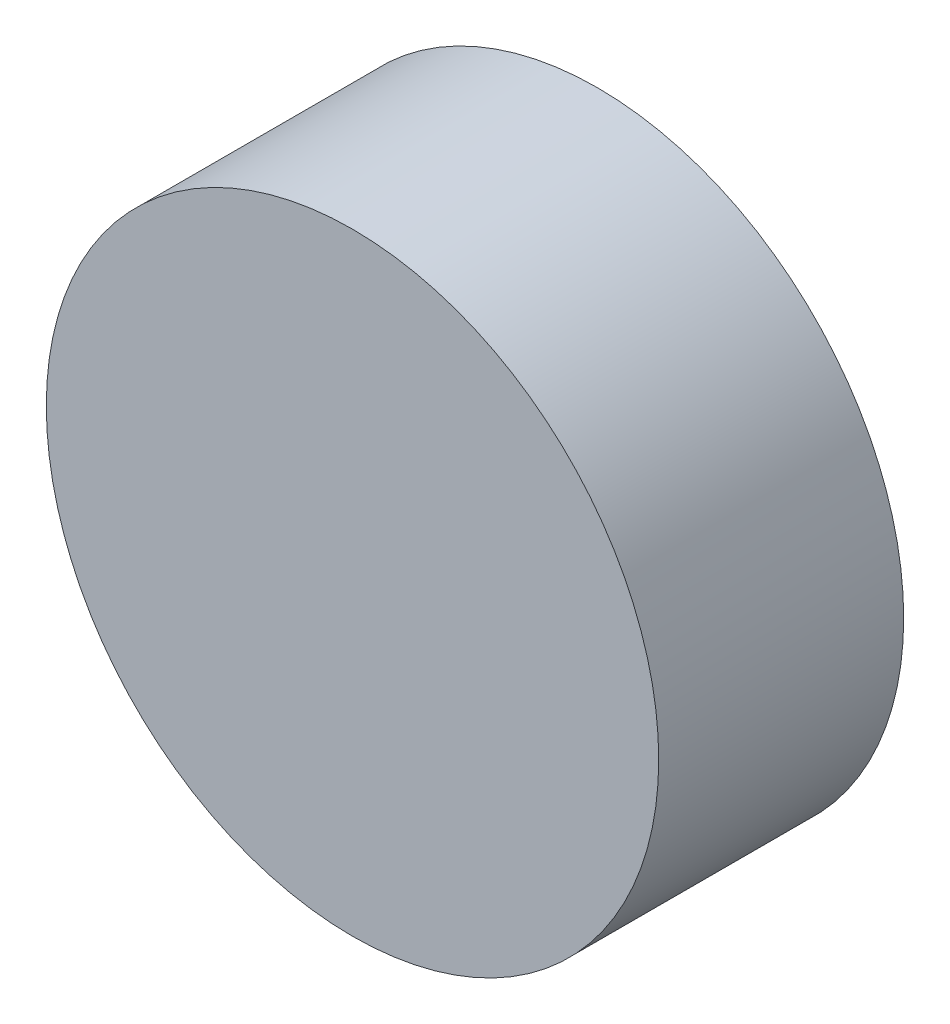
ISO-10303-21;
HEADER;
FILE_DESCRIPTION(('STEP AP214'),'2;1');
FILE_NAME('part.step','',(''),(''),'','','');
FILE_SCHEMA(('AUTOMOTIVE_DESIGN { 1 0 10303 214 1 1 1 1 }'));
ENDSEC;
DATA;
#1=APPLICATION_CONTEXT('core data for automotive mechanical design processes');
#2=APPLICATION_PROTOCOL_DEFINITION('international standard','automotive_design',2000,#1);
#3=PRODUCT_CONTEXT('',#1,'mechanical');
#4=PRODUCT('Part','Part','',(#3));
#5=PRODUCT_RELATED_PRODUCT_CATEGORY('part','',(#4));
#6=PRODUCT_DEFINITION_FORMATION('','',#4);
#7=PRODUCT_DEFINITION_CONTEXT('part definition',#1,'design');
#8=PRODUCT_DEFINITION('design','',#6,#7);
#9=PRODUCT_DEFINITION_SHAPE('','',#8);
#10=(LENGTH_UNIT() NAMED_UNIT(*) SI_UNIT(.MILLI.,.METRE.));
#11=(NAMED_UNIT(*) PLANE_ANGLE_UNIT() SI_UNIT($,.RADIAN.));
#12=(NAMED_UNIT(*) SI_UNIT($,.STERADIAN.) SOLID_ANGLE_UNIT());
#13=UNCERTAINTY_MEASURE_WITH_UNIT(LENGTH_MEASURE(1.E-05),#10,'distance_accuracy_value','');
#14=(GEOMETRIC_REPRESENTATION_CONTEXT(3) GLOBAL_UNCERTAINTY_ASSIGNED_CONTEXT((#13)) GLOBAL_UNIT_ASSIGNED_CONTEXT((#10,
#11,#12)) REPRESENTATION_CONTEXT('',''));
#15=CARTESIAN_POINT('',(0.,0.,0.));
#16=DIRECTION('',(0.,0.,1.));
#17=DIRECTION('',(1.,0.,0.));
#18=AXIS2_PLACEMENT_3D('',#15,#16,#17);
#19=CARTESIAN_POINT('',(0.,0.,30.));
#20=DIRECTION('',(0.,0.,1.));
#21=DIRECTION('',(1.,0.,0.));
#22=AXIS2_PLACEMENT_3D('',#19,#20,#21);
#23=CYLINDRICAL_SURFACE('',#22,12.5);
#24=CARTESIAN_POINT('',(0.,0.,10.));
#25=DIRECTION('',(0.,0.,1.));
#26=DIRECTION('',(1.,0.,0.));
#27=AXIS2_PLACEMENT_3D('',#24,#25,#26);
#28=CIRCLE('',#27,12.5);
#29=CARTESIAN_POINT('',(12.5,0.,10.));
#30=VERTEX_POINT('',#29);
#31=EDGE_CURVE('E8',#30,#30,#28,.T.);
#32=ORIENTED_EDGE('',*,*,#31,.F.);
#33=EDGE_LOOP('',(#32));
#34=FACE_BOUND('',#33,.T.);
#35=CARTESIAN_POINT('',(0.,0.,0.));
#36=DIRECTION('',(0.,0.,1.));
#37=DIRECTION('',(1.,0.,0.));
#38=AXIS2_PLACEMENT_3D('',#35,#36,#37);
#39=CIRCLE('',#38,12.5);
#40=CARTESIAN_POINT('',(12.5,0.,0.));
#41=VERTEX_POINT('',#40);
#42=EDGE_CURVE('E27',#41,#41,#39,.T.);
#43=ORIENTED_EDGE('',*,*,#42,.T.);
#44=EDGE_LOOP('',(#43));
#45=FACE_BOUND('',#44,.T.);
#46=ADVANCED_FACE('F13',(#34,#45),#23,.T.);
#47=CARTESIAN_POINT('',(12.5,0.,10.));
#48=DIRECTION('',(0.,0.,-1.));
#49=DIRECTION('',(-1.,0.,0.));
#50=AXIS2_PLACEMENT_3D('',#47,#48,#49);
#51=PLANE('',#50);
#52=ORIENTED_EDGE('',*,*,#31,.T.);
#53=EDGE_LOOP('',(#52));
#54=FACE_BOUND('',#53,.T.);
#55=ADVANCED_FACE('F49',(#54),#51,.F.);
#56=CARTESIAN_POINT('',(0.,0.,5.));
#57=DIRECTION('',(0.,0.,1.));
#58=DIRECTION('',(1.,0.,0.));
#59=AXIS2_PLACEMENT_3D('',#56,#57,#58);
#60=PLANE('',#59);
#61=CARTESIAN_POINT('',(0.,0.,5.));
#62=DIRECTION('',(0.,0.,1.));
#63=DIRECTION('',(1.,0.,0.));
#64=AXIS2_PLACEMENT_3D('',#61,#62,#63);
#65=CIRCLE('',#64,3.);
#66=CARTESIAN_POINT('',(3.,0.,5.));
#67=VERTEX_POINT('',#66);
#68=EDGE_CURVE('E19',#67,#67,#65,.T.);
#69=ORIENTED_EDGE('',*,*,#68,.F.);
#70=EDGE_LOOP('',(#69));
#71=FACE_BOUND('',#70,.T.);
#72=ADVANCED_FACE('F42',(#71),#60,.F.);
#73=CARTESIAN_POINT('',(0.,0.,30.));
#74=DIRECTION('',(0.,0.,1.));
#75=DIRECTION('',(1.,0.,0.));
#76=AXIS2_PLACEMENT_3D('',#73,#74,#75);
#77=CYLINDRICAL_SURFACE('',#76,3.);
#78=CARTESIAN_POINT('',(0.,0.,0.));
#79=DIRECTION('',(0.,0.,1.));
#80=DIRECTION('',(1.,0.,0.));
#81=AXIS2_PLACEMENT_3D('',#78,#79,#80);
#82=CIRCLE('',#81,3.);
#83=CARTESIAN_POINT('',(3.,0.,0.));
#84=VERTEX_POINT('',#83);
#85=EDGE_CURVE('E23',#84,#84,#82,.T.);
#86=ORIENTED_EDGE('',*,*,#85,.F.);
#87=EDGE_LOOP('',(#86));
#88=FACE_BOUND('',#87,.T.);
#89=ORIENTED_EDGE('',*,*,#68,.T.);
#90=EDGE_LOOP('',(#89));
#91=FACE_BOUND('',#90,.T.);
#92=ADVANCED_FACE('F37',(#88,#91),#77,.F.);
#93=CARTESIAN_POINT('',(3.,0.,0.));
#94=DIRECTION('',(0.,0.,1.));
#95=DIRECTION('',(1.,0.,0.));
#96=AXIS2_PLACEMENT_3D('',#93,#94,#95);
#97=PLANE('',#96);
#98=ORIENTED_EDGE('',*,*,#42,.F.);
#99=EDGE_LOOP('',(#98));
#100=FACE_BOUND('',#99,.T.);
#101=ORIENTED_EDGE('',*,*,#85,.T.);
#102=EDGE_LOOP('',(#101));
#103=FACE_BOUND('',#102,.T.);
#104=ADVANCED_FACE('F34',(#100,#103),#97,.F.);
#105=CLOSED_SHELL('',(#46,#55,#72,#92,#104));
#106=MANIFOLD_SOLID_BREP('B1',#105);
#107=ADVANCED_BREP_SHAPE_REPRESENTATION('',(#18,#106),#14);
#108=SHAPE_DEFINITION_REPRESENTATION(#9,#107);
ENDSEC;
END-ISO-10303-21;
